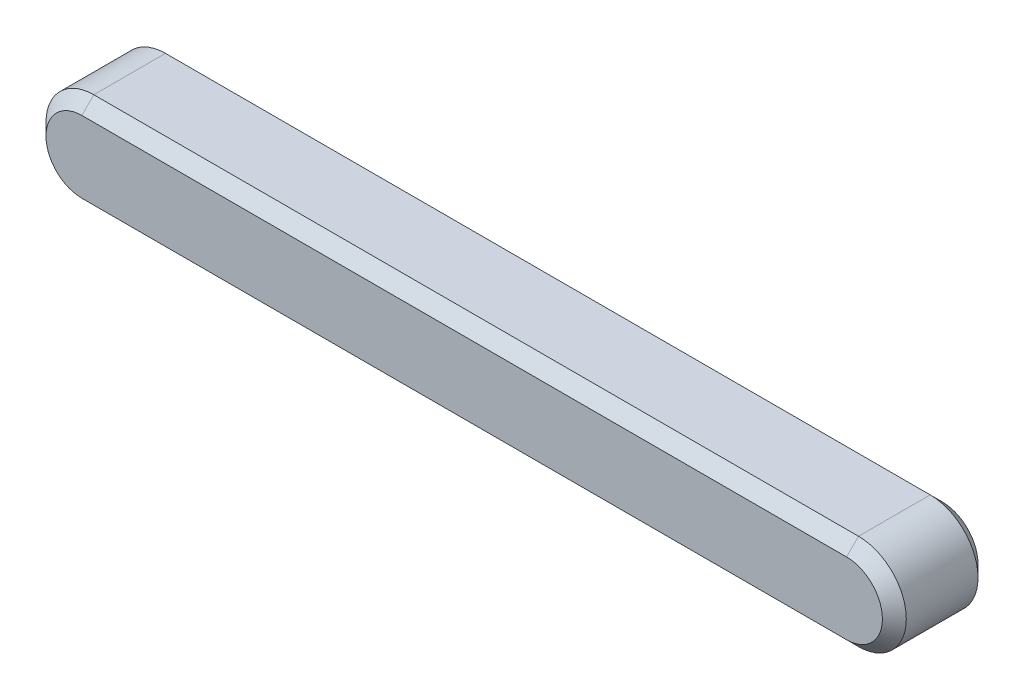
ISO-10303-21;
HEADER;
FILE_DESCRIPTION(('STEP AP214'),'2;1');
FILE_NAME('part.step','',(''),(''),'','','');
FILE_SCHEMA(('AUTOMOTIVE_DESIGN { 1 0 10303 214 1 1 1 1 }'));
ENDSEC;
DATA;
#1=APPLICATION_CONTEXT('core data for automotive mechanical design processes');
#2=APPLICATION_PROTOCOL_DEFINITION('international standard','automotive_design',2000,#1);
#3=PRODUCT_CONTEXT('',#1,'mechanical');
#4=PRODUCT('Part','Part','',(#3));
#5=PRODUCT_RELATED_PRODUCT_CATEGORY('part','',(#4));
#6=PRODUCT_DEFINITION_FORMATION('','',#4);
#7=PRODUCT_DEFINITION_CONTEXT('part definition',#1,'design');
#8=PRODUCT_DEFINITION('design','',#6,#7);
#9=PRODUCT_DEFINITION_SHAPE('','',#8);
#10=(LENGTH_UNIT() NAMED_UNIT(*) SI_UNIT(.MILLI.,.METRE.));
#11=(NAMED_UNIT(*) PLANE_ANGLE_UNIT() SI_UNIT($,.RADIAN.));
#12=(NAMED_UNIT(*) SI_UNIT($,.STERADIAN.) SOLID_ANGLE_UNIT());
#13=UNCERTAINTY_MEASURE_WITH_UNIT(LENGTH_MEASURE(1.E-05),#10,'distance_accuracy_value','');
#14=(GEOMETRIC_REPRESENTATION_CONTEXT(3) GLOBAL_UNCERTAINTY_ASSIGNED_CONTEXT((#13)) GLOBAL_UNIT_ASSIGNED_CONTEXT((#10,
#11,#12)) REPRESENTATION_CONTEXT('',''));
#15=CARTESIAN_POINT('',(0.,0.,0.));
#16=DIRECTION('',(0.,0.,1.));
#17=DIRECTION('',(1.,0.,0.));
#18=AXIS2_PLACEMENT_3D('',#15,#16,#17);
#19=CARTESIAN_POINT('',(0.,1.,2.));
#20=DIRECTION('',(0.,0.,-1.));
#21=DIRECTION('',(-1.,0.,0.));
#22=AXIS2_PLACEMENT_3D('',#19,#20,#21);
#23=CYLINDRICAL_SURFACE('',#22,1.);
#24=DIRECTION('',(0.,0.,-1.));
#25=VECTOR('',#24,1.);
#26=CARTESIAN_POINT('',(0.,2.,2.));
#27=LINE('',#26,#25);
#28=CARTESIAN_POINT('',(0.,2.,1.75));
#29=VERTEX_POINT('',#28);
#30=CARTESIAN_POINT('',(0.,2.,0.250000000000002));
#31=VERTEX_POINT('',#30);
#32=EDGE_CURVE('E152',#29,#31,#27,.T.);
#33=ORIENTED_EDGE('',*,*,#32,.T.);
#34=CARTESIAN_POINT('',(0.,1.,0.250000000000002));
#35=DIRECTION('',(0.,0.,-1.));
#36=DIRECTION('',(-1.,0.,0.));
#37=AXIS2_PLACEMENT_3D('',#34,#35,#36);
#38=CIRCLE('',#37,1.);
#39=CARTESIAN_POINT('',(0.,0.,0.250000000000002));
#40=VERTEX_POINT('',#39);
#41=EDGE_CURVE('E119',#31,#40,#38,.F.);
#42=ORIENTED_EDGE('',*,*,#41,.T.);
#43=DIRECTION('',(0.,0.,-1.));
#44=VECTOR('',#43,1.);
#45=CARTESIAN_POINT('',(0.,0.,2.));
#46=LINE('',#45,#44);
#47=CARTESIAN_POINT('',(0.,0.,1.75));
#48=VERTEX_POINT('',#47);
#49=EDGE_CURVE('E103',#48,#40,#46,.T.);
#50=ORIENTED_EDGE('',*,*,#49,.F.);
#51=CARTESIAN_POINT('',(0.,1.,1.75));
#52=DIRECTION('',(0.,0.,-1.));
#53=DIRECTION('',(-1.,0.,0.));
#54=AXIS2_PLACEMENT_3D('',#51,#52,#53);
#55=CIRCLE('',#54,1.);
#56=EDGE_CURVE('E116',#48,#29,#55,.T.);
#57=ORIENTED_EDGE('',*,*,#56,.T.);
#58=EDGE_LOOP('',(#33,#42,#50,#57));
#59=FACE_BOUND('',#58,.T.);
#60=ADVANCED_FACE('F32',(#59),#23,.T.);
#61=CARTESIAN_POINT('',(0.,0.,2.));
#62=DIRECTION('',(0.,1.,0.));
#63=DIRECTION('',(0.,0.,1.));
#64=AXIS2_PLACEMENT_3D('',#61,#62,#63);
#65=PLANE('',#64);
#66=ORIENTED_EDGE('',*,*,#49,.T.);
#67=DIRECTION('',(1.,0.,0.));
#68=VECTOR('',#67,1.);
#69=CARTESIAN_POINT('',(16.,0.,0.250000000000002));
#70=LINE('',#69,#68);
#71=CARTESIAN_POINT('',(16.,0.,0.250000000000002));
#72=VERTEX_POINT('',#71);
#73=EDGE_CURVE('E109',#40,#72,#70,.T.);
#74=ORIENTED_EDGE('',*,*,#73,.T.);
#75=DIRECTION('',(0.,0.,-1.));
#76=VECTOR('',#75,1.);
#77=CARTESIAN_POINT('',(16.,0.,2.));
#78=LINE('',#77,#76);
#79=CARTESIAN_POINT('',(16.,0.,1.75));
#80=VERTEX_POINT('',#79);
#81=EDGE_CURVE('E105',#80,#72,#78,.T.);
#82=ORIENTED_EDGE('',*,*,#81,.F.);
#83=DIRECTION('',(-1.,0.,0.));
#84=VECTOR('',#83,1.);
#85=CARTESIAN_POINT('',(0.,0.,1.75));
#86=LINE('',#85,#84);
#87=EDGE_CURVE('E100',#80,#48,#86,.T.);
#88=ORIENTED_EDGE('',*,*,#87,.T.);
#89=EDGE_LOOP('',(#66,#74,#82,#88));
#90=FACE_BOUND('',#89,.T.);
#91=ADVANCED_FACE('F102',(#90),#65,.F.);
#92=CARTESIAN_POINT('',(16.,1.,2.));
#93=DIRECTION('',(0.,0.,-1.));
#94=DIRECTION('',(-1.,0.,0.));
#95=AXIS2_PLACEMENT_3D('',#92,#93,#94);
#96=CYLINDRICAL_SURFACE('',#95,1.);
#97=ORIENTED_EDGE('',*,*,#81,.T.);
#98=CARTESIAN_POINT('',(16.,1.,0.250000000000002));
#99=DIRECTION('',(0.,0.,-1.));
#100=DIRECTION('',(-1.,0.,0.));
#101=AXIS2_PLACEMENT_3D('',#98,#99,#100);
#102=CIRCLE('',#101,1.);
#103=CARTESIAN_POINT('',(16.,2.,0.250000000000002));
#104=VERTEX_POINT('',#103);
#105=EDGE_CURVE('E176',#72,#104,#102,.F.);
#106=ORIENTED_EDGE('',*,*,#105,.T.);
#107=DIRECTION('',(0.,0.,-1.));
#108=VECTOR('',#107,1.);
#109=CARTESIAN_POINT('',(16.,2.,2.));
#110=LINE('',#109,#108);
#111=CARTESIAN_POINT('',(16.,2.,1.75));
#112=VERTEX_POINT('',#111);
#113=EDGE_CURVE('E157',#112,#104,#110,.T.);
#114=ORIENTED_EDGE('',*,*,#113,.F.);
#115=CARTESIAN_POINT('',(16.,1.,1.75));
#116=DIRECTION('',(0.,0.,-1.));
#117=DIRECTION('',(-1.,0.,0.));
#118=AXIS2_PLACEMENT_3D('',#115,#116,#117);
#119=CIRCLE('',#118,1.);
#120=EDGE_CURVE('E174',#112,#80,#119,.T.);
#121=ORIENTED_EDGE('',*,*,#120,.T.);
#122=EDGE_LOOP('',(#97,#106,#114,#121));
#123=FACE_BOUND('',#122,.T.);
#124=ADVANCED_FACE('F193',(#123),#96,.T.);
#125=CARTESIAN_POINT('',(0.,2.,2.));
#126=DIRECTION('',(0.,-1.,0.));
#127=DIRECTION('',(1.,0.,0.));
#128=AXIS2_PLACEMENT_3D('',#125,#126,#127);
#129=PLANE('',#128);
#130=ORIENTED_EDGE('',*,*,#113,.T.);
#131=DIRECTION('',(-1.,0.,0.));
#132=VECTOR('',#131,1.);
#133=CARTESIAN_POINT('',(0.,2.,0.250000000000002));
#134=LINE('',#133,#132);
#135=EDGE_CURVE('E180',#104,#31,#134,.T.);
#136=ORIENTED_EDGE('',*,*,#135,.T.);
#137=ORIENTED_EDGE('',*,*,#32,.F.);
#138=DIRECTION('',(1.,0.,0.));
#139=VECTOR('',#138,1.);
#140=CARTESIAN_POINT('',(0.,2.,1.75));
#141=LINE('',#140,#139);
#142=EDGE_CURVE('E178',#29,#112,#141,.T.);
#143=ORIENTED_EDGE('',*,*,#142,.T.);
#144=EDGE_LOOP('',(#130,#136,#137,#143));
#145=FACE_BOUND('',#144,.T.);
#146=ADVANCED_FACE('F191',(#145),#129,.F.);
#147=CARTESIAN_POINT('',(0.,1.,2.));
#148=DIRECTION('',(0.,0.,-1.));
#149=DIRECTION('',(-1.,0.,0.));
#150=AXIS2_PLACEMENT_3D('',#147,#148,#149);
#151=PLANE('',#150);
#152=DIRECTION('',(-1.,0.,0.));
#153=VECTOR('',#152,1.);
#154=CARTESIAN_POINT('',(0.,1.75,2.));
#155=LINE('',#154,#153);
#156=CARTESIAN_POINT('',(16.,1.75,2.));
#157=VERTEX_POINT('',#156);
#158=CARTESIAN_POINT('',(0.,1.75,2.));
#159=VERTEX_POINT('',#158);
#160=EDGE_CURVE('E182',#157,#159,#155,.T.);
#161=ORIENTED_EDGE('',*,*,#160,.T.);
#162=CARTESIAN_POINT('',(0.,1.,2.));
#163=DIRECTION('',(0.,0.,-1.));
#164=DIRECTION('',(-1.,0.,0.));
#165=AXIS2_PLACEMENT_3D('',#162,#163,#164);
#166=CIRCLE('',#165,0.750000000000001);
#167=CARTESIAN_POINT('',(0.,0.25,2.));
#168=VERTEX_POINT('',#167);
#169=EDGE_CURVE('E11',#159,#168,#166,.F.);
#170=ORIENTED_EDGE('',*,*,#169,.T.);
#171=DIRECTION('',(1.,0.,0.));
#172=VECTOR('',#171,1.);
#173=CARTESIAN_POINT('',(0.,0.25,2.));
#174=LINE('',#173,#172);
#175=CARTESIAN_POINT('',(16.,0.25,2.));
#176=VERTEX_POINT('',#175);
#177=EDGE_CURVE('E41',#168,#176,#174,.T.);
#178=ORIENTED_EDGE('',*,*,#177,.T.);
#179=CARTESIAN_POINT('',(16.,1.,2.));
#180=DIRECTION('',(0.,0.,-1.));
#181=DIRECTION('',(-1.,0.,0.));
#182=AXIS2_PLACEMENT_3D('',#179,#180,#181);
#183=CIRCLE('',#182,0.75);
#184=EDGE_CURVE('E184',#176,#157,#183,.F.);
#185=ORIENTED_EDGE('',*,*,#184,.T.);
#186=EDGE_LOOP('',(#161,#170,#178,#185));
#187=FACE_BOUND('',#186,.T.);
#188=ADVANCED_FACE('F185',(#187),#151,.F.);
#189=CARTESIAN_POINT('',(0.,1.,0.));
#190=DIRECTION('',(0.,0.,-1.));
#191=DIRECTION('',(-1.,0.,0.));
#192=AXIS2_PLACEMENT_3D('',#189,#190,#191);
#193=PLANE('',#192);
#194=DIRECTION('',(-1.,0.,0.));
#195=VECTOR('',#194,1.);
#196=CARTESIAN_POINT('',(0.,0.250000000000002,0.));
#197=LINE('',#196,#195);
#198=CARTESIAN_POINT('',(16.,0.250000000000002,0.));
#199=VERTEX_POINT('',#198);
#200=CARTESIAN_POINT('',(0.,0.250000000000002,0.));
#201=VERTEX_POINT('',#200);
#202=EDGE_CURVE('E169',#199,#201,#197,.T.);
#203=ORIENTED_EDGE('',*,*,#202,.T.);
#204=CARTESIAN_POINT('',(0.,1.,0.));
#205=DIRECTION('',(0.,0.,-1.));
#206=DIRECTION('',(-1.,0.,0.));
#207=AXIS2_PLACEMENT_3D('',#204,#205,#206);
#208=CIRCLE('',#207,0.749999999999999);
#209=CARTESIAN_POINT('',(0.,1.75,0.));
#210=VERTEX_POINT('',#209);
#211=EDGE_CURVE('E110',#201,#210,#208,.T.);
#212=ORIENTED_EDGE('',*,*,#211,.T.);
#213=DIRECTION('',(1.,0.,0.));
#214=VECTOR('',#213,1.);
#215=CARTESIAN_POINT('',(16.,1.75,0.));
#216=LINE('',#215,#214);
#217=CARTESIAN_POINT('',(16.,1.75,0.));
#218=VERTEX_POINT('',#217);
#219=EDGE_CURVE('E165',#210,#218,#216,.T.);
#220=ORIENTED_EDGE('',*,*,#219,.T.);
#221=CARTESIAN_POINT('',(16.,1.,0.));
#222=DIRECTION('',(0.,0.,-1.));
#223=DIRECTION('',(-1.,0.,0.));
#224=AXIS2_PLACEMENT_3D('',#221,#222,#223);
#225=CIRCLE('',#224,0.749999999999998);
#226=EDGE_CURVE('E167',#218,#199,#225,.T.);
#227=ORIENTED_EDGE('',*,*,#226,.T.);
#228=EDGE_LOOP('',(#203,#212,#220,#227));
#229=FACE_BOUND('',#228,.T.);
#230=ADVANCED_FACE('F219',(#229),#193,.T.);
#231=CARTESIAN_POINT('',(16.,1.,0.250000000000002));
#232=DIRECTION('',(0.,0.,1.));
#233=DIRECTION('',(1.,0.,0.));
#234=AXIS2_PLACEMENT_3D('',#231,#232,#233);
#235=CONICAL_SURFACE('',#234,1.,0.785398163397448);
#236=DIRECTION('',(0.,-0.707106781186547,0.707106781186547));
#237=VECTOR('',#236,1.);
#238=CARTESIAN_POINT('',(16.,0.250000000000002,0.));
#239=LINE('',#238,#237);
#240=EDGE_CURVE('E144',#199,#72,#239,.T.);
#241=ORIENTED_EDGE('',*,*,#240,.F.);
#242=ORIENTED_EDGE('',*,*,#226,.F.);
#243=DIRECTION('',(0.,-0.707106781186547,-0.707106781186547));
#244=VECTOR('',#243,1.);
#245=CARTESIAN_POINT('',(16.,2.,0.250000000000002));
#246=LINE('',#245,#244);
#247=EDGE_CURVE('E131',#104,#218,#246,.T.);
#248=ORIENTED_EDGE('',*,*,#247,.F.);
#249=ORIENTED_EDGE('',*,*,#105,.F.);
#250=EDGE_LOOP('',(#241,#242,#248,#249));
#251=FACE_BOUND('',#250,.T.);
#252=ADVANCED_FACE('F196',(#251),#235,.T.);
#253=CARTESIAN_POINT('',(0.,2.,0.250000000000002));
#254=DIRECTION('',(0.,0.707106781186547,-0.707106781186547));
#255=DIRECTION('',(0.,0.707106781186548,0.707106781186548));
#256=AXIS2_PLACEMENT_3D('',#253,#254,#255);
#257=PLANE('',#256);
#258=ORIENTED_EDGE('',*,*,#247,.T.);
#259=ORIENTED_EDGE('',*,*,#219,.F.);
#260=DIRECTION('',(0.,-0.707106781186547,-0.707106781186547));
#261=VECTOR('',#260,1.);
#262=CARTESIAN_POINT('',(0.,2.,0.250000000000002));
#263=LINE('',#262,#261);
#264=EDGE_CURVE('E138',#31,#210,#263,.T.);
#265=ORIENTED_EDGE('',*,*,#264,.F.);
#266=ORIENTED_EDGE('',*,*,#135,.F.);
#267=EDGE_LOOP('',(#258,#259,#265,#266));
#268=FACE_BOUND('',#267,.T.);
#269=ADVANCED_FACE('F198',(#268),#257,.T.);
#270=CARTESIAN_POINT('',(0.,0.,0.250000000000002));
#271=DIRECTION('',(0.,-0.707106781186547,-0.707106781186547));
#272=DIRECTION('',(0.,0.707106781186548,-0.707106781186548));
#273=AXIS2_PLACEMENT_3D('',#270,#271,#272);
#274=PLANE('',#273);
#275=ORIENTED_EDGE('',*,*,#240,.T.);
#276=ORIENTED_EDGE('',*,*,#73,.F.);
#277=DIRECTION('',(0.,-0.707106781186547,0.707106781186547));
#278=VECTOR('',#277,1.);
#279=CARTESIAN_POINT('',(0.,0.250000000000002,0.));
#280=LINE('',#279,#278);
#281=EDGE_CURVE('E134',#201,#40,#280,.T.);
#282=ORIENTED_EDGE('',*,*,#281,.F.);
#283=ORIENTED_EDGE('',*,*,#202,.F.);
#284=EDGE_LOOP('',(#275,#276,#282,#283));
#285=FACE_BOUND('',#284,.T.);
#286=ADVANCED_FACE('F201',(#285),#274,.T.);
#287=CARTESIAN_POINT('',(0.,1.,0.250000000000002));
#288=DIRECTION('',(0.,0.,1.));
#289=DIRECTION('',(1.,0.,0.));
#290=AXIS2_PLACEMENT_3D('',#287,#288,#289);
#291=CONICAL_SURFACE('',#290,1.,0.785398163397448);
#292=ORIENTED_EDGE('',*,*,#264,.T.);
#293=ORIENTED_EDGE('',*,*,#211,.F.);
#294=ORIENTED_EDGE('',*,*,#281,.T.);
#295=ORIENTED_EDGE('',*,*,#41,.F.);
#296=EDGE_LOOP('',(#292,#293,#294,#295));
#297=FACE_BOUND('',#296,.T.);
#298=ADVANCED_FACE('F199',(#297),#291,.T.);
#299=CARTESIAN_POINT('',(16.,1.,2.));
#300=DIRECTION('',(0.,0.,-1.));
#301=DIRECTION('',(-1.,0.,0.));
#302=AXIS2_PLACEMENT_3D('',#299,#300,#301);
#303=CONICAL_SURFACE('',#302,0.75,0.785398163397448);
#304=DIRECTION('',(0.,0.707106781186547,0.707106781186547));
#305=VECTOR('',#304,1.);
#306=CARTESIAN_POINT('',(16.,0.,1.75));
#307=LINE('',#306,#305);
#308=EDGE_CURVE('E128',#80,#176,#307,.T.);
#309=ORIENTED_EDGE('',*,*,#308,.F.);
#310=ORIENTED_EDGE('',*,*,#120,.F.);
#311=DIRECTION('',(0.,0.707106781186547,-0.707106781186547));
#312=VECTOR('',#311,1.);
#313=CARTESIAN_POINT('',(16.,1.75,2.));
#314=LINE('',#313,#312);
#315=EDGE_CURVE('E36',#157,#112,#314,.T.);
#316=ORIENTED_EDGE('',*,*,#315,.F.);
#317=ORIENTED_EDGE('',*,*,#184,.F.);
#318=EDGE_LOOP('',(#309,#310,#316,#317));
#319=FACE_BOUND('',#318,.T.);
#320=ADVANCED_FACE('F34',(#319),#303,.T.);
#321=CARTESIAN_POINT('',(0.,1.75,2.));
#322=DIRECTION('',(0.,-0.707106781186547,-0.707106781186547));
#323=DIRECTION('',(0.,0.707106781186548,-0.707106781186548));
#324=AXIS2_PLACEMENT_3D('',#321,#322,#323);
#325=PLANE('',#324);
#326=ORIENTED_EDGE('',*,*,#315,.T.);
#327=ORIENTED_EDGE('',*,*,#142,.F.);
#328=DIRECTION('',(0.,0.707106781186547,-0.707106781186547));
#329=VECTOR('',#328,1.);
#330=CARTESIAN_POINT('',(0.,1.75,2.));
#331=LINE('',#330,#329);
#332=EDGE_CURVE('E123',#159,#29,#331,.T.);
#333=ORIENTED_EDGE('',*,*,#332,.F.);
#334=ORIENTED_EDGE('',*,*,#160,.F.);
#335=EDGE_LOOP('',(#326,#327,#333,#334));
#336=FACE_BOUND('',#335,.T.);
#337=ADVANCED_FACE('F188',(#336),#325,.F.);
#338=CARTESIAN_POINT('',(0.,0.25,2.));
#339=DIRECTION('',(0.,0.707106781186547,-0.707106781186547));
#340=DIRECTION('',(0.,0.707106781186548,0.707106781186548));
#341=AXIS2_PLACEMENT_3D('',#338,#339,#340);
#342=PLANE('',#341);
#343=ORIENTED_EDGE('',*,*,#308,.T.);
#344=ORIENTED_EDGE('',*,*,#177,.F.);
#345=DIRECTION('',(0.,0.707106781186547,0.707106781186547));
#346=VECTOR('',#345,1.);
#347=CARTESIAN_POINT('',(0.,0.,1.75));
#348=LINE('',#347,#346);
#349=EDGE_CURVE('E49',#48,#168,#348,.T.);
#350=ORIENTED_EDGE('',*,*,#349,.F.);
#351=ORIENTED_EDGE('',*,*,#87,.F.);
#352=EDGE_LOOP('',(#343,#344,#350,#351));
#353=FACE_BOUND('',#352,.T.);
#354=ADVANCED_FACE('F126',(#353),#342,.F.);
#355=CARTESIAN_POINT('',(0.,1.,2.));
#356=DIRECTION('',(0.,0.,-1.));
#357=DIRECTION('',(-1.,0.,0.));
#358=AXIS2_PLACEMENT_3D('',#355,#356,#357);
#359=CONICAL_SURFACE('',#358,0.750000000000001,0.785398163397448);
#360=ORIENTED_EDGE('',*,*,#332,.T.);
#361=ORIENTED_EDGE('',*,*,#56,.F.);
#362=ORIENTED_EDGE('',*,*,#349,.T.);
#363=ORIENTED_EDGE('',*,*,#169,.F.);
#364=EDGE_LOOP('',(#360,#361,#362,#363));
#365=FACE_BOUND('',#364,.T.);
#366=ADVANCED_FACE('F121',(#365),#359,.T.);
#367=CLOSED_SHELL('',(#60,#91,#124,#146,#188,#230,#252,#269,#286,#298,#320,#337,#354,#366));
#368=MANIFOLD_SOLID_BREP('B2',#367);
#369=ADVANCED_BREP_SHAPE_REPRESENTATION('',(#18,#368),#14);
#370=SHAPE_DEFINITION_REPRESENTATION(#9,#369);
ENDSEC;
END-ISO-10303-21;
